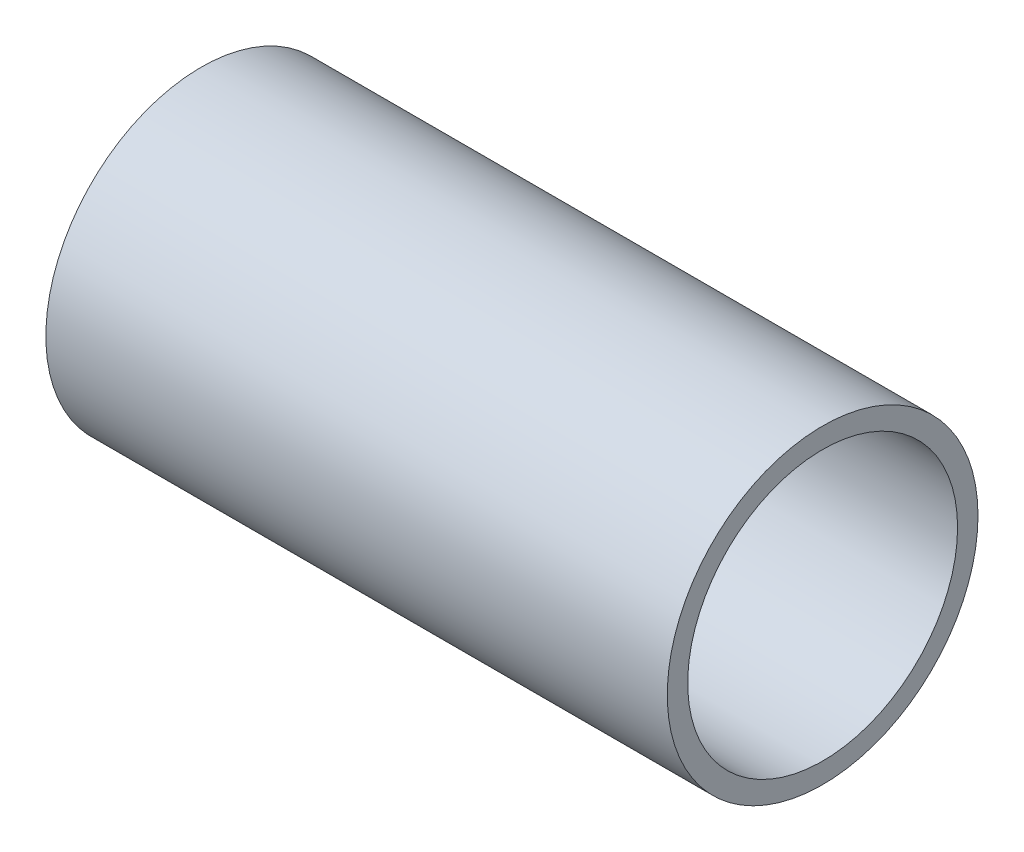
from build123d import *


with BuildPart() as part:
    # Sketch1 → Revolve1 (revolve)
    with BuildSketch(Plane.XY, mode=Mode.PRIVATE) as revolve1_sk:
        Polygon((0, 44.45), (-177.8, 44.45), (-177.8, 29.845), (-163.83, 29.845), (-152.4, 38.608), (0, 38.608), align=None)
    revolve(revolve1_sk.sketch.rotate(Axis((0, 0, 0), (-1, 0, 0)), 90), axis=Axis((0, 0, 0), (-1, 0, 0)))


solid = part.part
